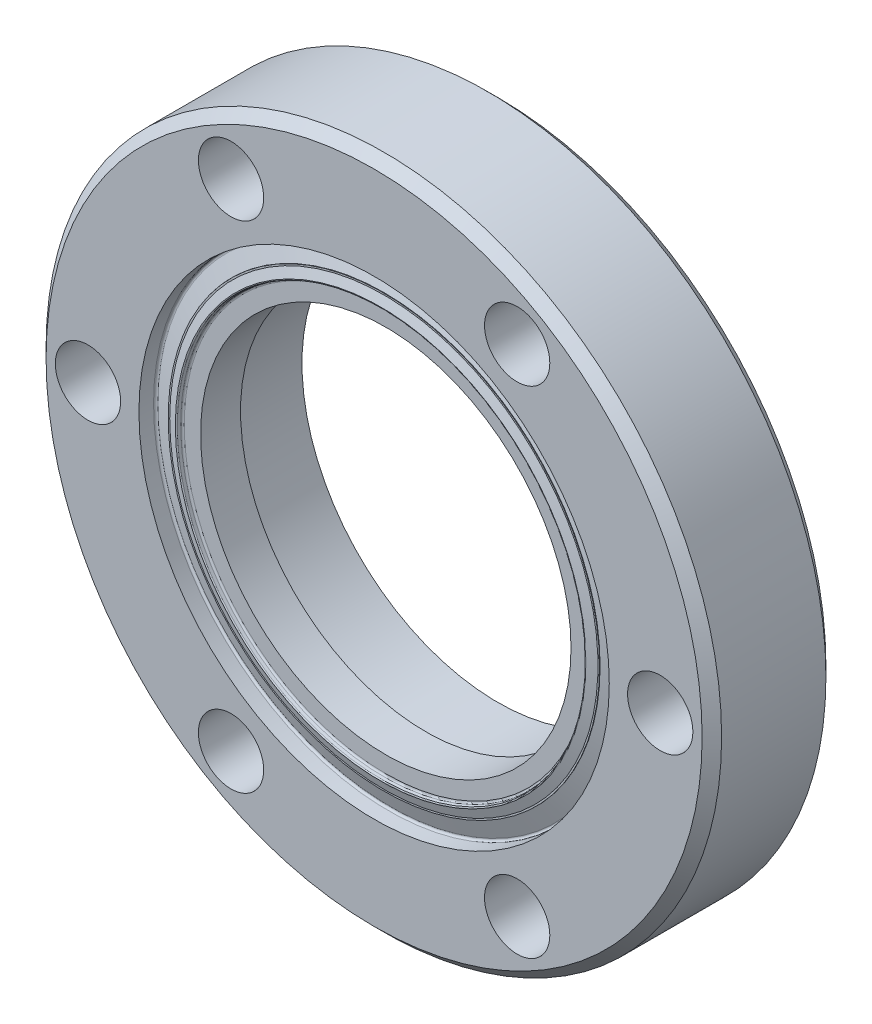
ISO-10303-21;
HEADER;
FILE_DESCRIPTION(('STEP AP214'),'2;1');
FILE_NAME('part.step','',(''),(''),'','','');
FILE_SCHEMA(('AUTOMOTIVE_DESIGN { 1 0 10303 214 1 1 1 1 }'));
ENDSEC;
DATA;
#1=APPLICATION_CONTEXT('core data for automotive mechanical design processes');
#2=APPLICATION_PROTOCOL_DEFINITION('international standard','automotive_design',2000,#1);
#3=PRODUCT_CONTEXT('',#1,'mechanical');
#4=PRODUCT('Part','Part','',(#3));
#5=PRODUCT_RELATED_PRODUCT_CATEGORY('part','',(#4));
#6=PRODUCT_DEFINITION_FORMATION('','',#4);
#7=PRODUCT_DEFINITION_CONTEXT('part definition',#1,'design');
#8=PRODUCT_DEFINITION('design','',#6,#7);
#9=PRODUCT_DEFINITION_SHAPE('','',#8);
#10=(LENGTH_UNIT() NAMED_UNIT(*) SI_UNIT(.MILLI.,.METRE.));
#11=(NAMED_UNIT(*) PLANE_ANGLE_UNIT() SI_UNIT($,.RADIAN.));
#12=(NAMED_UNIT(*) SI_UNIT($,.STERADIAN.) SOLID_ANGLE_UNIT());
#13=UNCERTAINTY_MEASURE_WITH_UNIT(LENGTH_MEASURE(1.E-05),#10,'distance_accuracy_value','');
#14=(GEOMETRIC_REPRESENTATION_CONTEXT(3) GLOBAL_UNCERTAINTY_ASSIGNED_CONTEXT((#13)) GLOBAL_UNIT_ASSIGNED_CONTEXT((#10,
#11,#12)) REPRESENTATION_CONTEXT('',''));
#15=CARTESIAN_POINT('',(0.,0.,0.));
#16=DIRECTION('',(0.,0.,1.));
#17=DIRECTION('',(1.,0.,0.));
#18=AXIS2_PLACEMENT_3D('',#15,#16,#17);
#19=CARTESIAN_POINT('',(0.,0.,11.7));
#20=DIRECTION('',(0.,0.,-1.));
#21=DIRECTION('',(-1.,0.,0.));
#22=AXIS2_PLACEMENT_3D('',#19,#20,#21);
#23=CONICAL_SURFACE('',#22,21.9665666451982,1.22173047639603);
#24=CARTESIAN_POINT('',(0.,0.,12.0292396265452));
#25=DIRECTION('',(0.,0.,1.));
#26=DIRECTION('',(1.,0.,0.));
#27=AXIS2_PLACEMENT_3D('',#24,#25,#26);
#28=CIRCLE('',#27,21.0619882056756);
#29=CARTESIAN_POINT('',(21.0619882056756,0.,12.0292396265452));
#30=VERTEX_POINT('',#29);
#31=EDGE_CURVE('E54',#30,#30,#28,.T.);
#32=ORIENTED_EDGE('',*,*,#31,.F.);
#33=EDGE_LOOP('',(#32));
#34=FACE_BOUND('',#33,.T.);
#35=CARTESIAN_POINT('',(0.,0.,11.7));
#36=DIRECTION('',(0.,0.,-1.));
#37=DIRECTION('',(-1.,0.,0.));
#38=AXIS2_PLACEMENT_3D('',#35,#36,#37);
#39=CIRCLE('',#38,21.9665666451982);
#40=CARTESIAN_POINT('',(-21.9665666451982,0.,11.7));
#41=VERTEX_POINT('',#40);
#42=EDGE_CURVE('E51',#41,#41,#39,.T.);
#43=ORIENTED_EDGE('',*,*,#42,.F.);
#44=EDGE_LOOP('',(#43));
#45=FACE_BOUND('',#44,.T.);
#46=ADVANCED_FACE('F19',(#34,#45),#23,.T.);
#47=CARTESIAN_POINT('',(0.,23.925,11.7));
#48=DIRECTION('',(0.,0.,1.));
#49=DIRECTION('',(1.,0.,0.));
#50=AXIS2_PLACEMENT_3D('',#47,#48,#49);
#51=PLANE('',#50);
#52=CARTESIAN_POINT('',(0.,0.,11.7));
#53=DIRECTION('',(0.,0.,1.));
#54=DIRECTION('',(1.,0.,0.));
#55=AXIS2_PLACEMENT_3D('',#52,#53,#54);
#56=CIRCLE('',#55,22.125);
#57=CARTESIAN_POINT('',(22.125,0.,11.7));
#58=VERTEX_POINT('',#57);
#59=EDGE_CURVE('E55',#58,#58,#56,.F.);
#60=ORIENTED_EDGE('',*,*,#59,.F.);
#61=EDGE_LOOP('',(#60));
#62=FACE_BOUND('',#61,.T.);
#63=ORIENTED_EDGE('',*,*,#42,.T.);
#64=EDGE_LOOP('',(#63));
#65=FACE_BOUND('',#64,.T.);
#66=ADVANCED_FACE('F124',(#62,#65),#51,.T.);
#67=CARTESIAN_POINT('',(0.,0.,11.9352703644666));
#68=DIRECTION('',(0.,0.,1.));
#69=DIRECTION('',(1.,0.,0.));
#70=AXIS2_PLACEMENT_3D('',#67,#68,#69);
#71=TOROIDAL_SURFACE('',#70,21.027786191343,0.0999999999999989);
#72=ORIENTED_EDGE('',*,*,#31,.T.);
#73=EDGE_LOOP('',(#72));
#74=FACE_BOUND('',#73,.T.);
#75=CARTESIAN_POINT('',(0.,0.,11.9526351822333));
#76=DIRECTION('',(0.,0.,1.));
#77=DIRECTION('',(1.,0.,0.));
#78=AXIS2_PLACEMENT_3D('',#75,#76,#77);
#79=CIRCLE('',#78,20.9293054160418);
#80=CARTESIAN_POINT('',(20.9293054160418,0.,11.9526351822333));
#81=VERTEX_POINT('',#80);
#82=EDGE_CURVE('E58',#81,#81,#79,.F.);
#83=ORIENTED_EDGE('',*,*,#82,.T.);
#84=EDGE_LOOP('',(#83));
#85=FACE_BOUND('',#84,.T.);
#86=ADVANCED_FACE('F120',(#74,#85),#71,.T.);
#87=CARTESIAN_POINT('',(0.,0.,31.6838263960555));
#88=DIRECTION('',(0.,0.,1.));
#89=DIRECTION('',(1.,0.,0.));
#90=AXIS2_PLACEMENT_3D('',#87,#88,#89);
#91=CYLINDRICAL_SURFACE('',#90,22.125);
#92=CARTESIAN_POINT('',(0.,0.,11.6423349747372));
#93=DIRECTION('',(0.,0.,-1.));
#94=DIRECTION('',(-1.,0.,0.));
#95=AXIS2_PLACEMENT_3D('',#92,#93,#94);
#96=CIRCLE('',#95,22.125);
#97=CARTESIAN_POINT('',(-22.125,0.,11.6423349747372));
#98=VERTEX_POINT('',#97);
#99=EDGE_CURVE('E256',#98,#98,#96,.T.);
#100=ORIENTED_EDGE('',*,*,#99,.F.);
#101=EDGE_LOOP('',(#100));
#102=FACE_BOUND('',#101,.T.);
#103=ORIENTED_EDGE('',*,*,#59,.T.);
#104=EDGE_LOOP('',(#103));
#105=FACE_BOUND('',#104,.T.);
#106=ADVANCED_FACE('F123',(#102,#105),#91,.T.);
#107=CARTESIAN_POINT('',(0.,0.,11.9526351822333));
#108=DIRECTION('',(0.,0.,1.));
#109=DIRECTION('',(1.,0.,0.));
#110=AXIS2_PLACEMENT_3D('',#107,#108,#109);
#111=CONICAL_SURFACE('',#110,20.9293054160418,0.174532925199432);
#112=ORIENTED_EDGE('',*,*,#82,.F.);
#113=EDGE_LOOP('',(#112));
#114=FACE_BOUND('',#113,.T.);
#115=CARTESIAN_POINT('',(0.,0.,11.6652703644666));
#116=DIRECTION('',(0.,0.,1.));
#117=DIRECTION('',(1.,0.,0.));
#118=AXIS2_PLACEMENT_3D('',#115,#116,#117);
#119=CIRCLE('',#118,20.8786352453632);
#120=CARTESIAN_POINT('',(20.8786352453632,0.,11.6652703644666));
#121=VERTEX_POINT('',#120);
#122=EDGE_CURVE('E254',#121,#121,#119,.F.);
#123=ORIENTED_EDGE('',*,*,#122,.T.);
#124=EDGE_LOOP('',(#123));
#125=FACE_BOUND('',#124,.T.);
#126=ADVANCED_FACE('F264',(#114,#125),#111,.F.);
#127=CARTESIAN_POINT('',(0.,0.,11.012085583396));
#128=DIRECTION('',(0.,0.,-1.));
#129=DIRECTION('',(-1.,0.,0.));
#130=AXIS2_PLACEMENT_3D('',#127,#128,#129);
#131=CONICAL_SURFACE('',#130,23.8565959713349,1.22173047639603);
#132=ORIENTED_EDGE('',*,*,#99,.T.);
#133=EDGE_LOOP('',(#132));
#134=FACE_BOUND('',#133,.T.);
#135=CARTESIAN_POINT('',(0.,0.,11.012085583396));
#136=DIRECTION('',(0.,0.,1.));
#137=DIRECTION('',(1.,0.,0.));
#138=AXIS2_PLACEMENT_3D('',#135,#136,#137);
#139=CIRCLE('',#138,23.8565959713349);
#140=CARTESIAN_POINT('',(23.8565959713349,0.,11.012085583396));
#141=VERTEX_POINT('',#140);
#142=EDGE_CURVE('E49',#141,#141,#139,.T.);
#143=ORIENTED_EDGE('',*,*,#142,.T.);
#144=EDGE_LOOP('',(#143));
#145=FACE_BOUND('',#144,.T.);
#146=ADVANCED_FACE('F241',(#134,#145),#131,.T.);
#147=CARTESIAN_POINT('',(0.,0.,11.7));
#148=DIRECTION('',(0.,0.,1.));
#149=DIRECTION('',(1.,0.,0.));
#150=AXIS2_PLACEMENT_3D('',#147,#148,#149);
#151=TOROIDAL_SURFACE('',#150,20.6816736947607,0.199999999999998);
#152=ORIENTED_EDGE('',*,*,#122,.F.);
#153=EDGE_LOOP('',(#152));
#154=FACE_BOUND('',#153,.T.);
#155=CARTESIAN_POINT('',(0.,0.,11.5));
#156=DIRECTION('',(0.,0.,-1.));
#157=DIRECTION('',(1.,0.,0.));
#158=AXIS2_PLACEMENT_3D('',#155,#156,#157);
#159=CIRCLE('',#158,20.6816736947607);
#160=CARTESIAN_POINT('',(-20.6816736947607,0.,11.5));
#161=VERTEX_POINT('',#160);
#162=CARTESIAN_POINT('',(20.6816736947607,0.,11.5));
#163=VERTEX_POINT('',#162);
#164=EDGE_CURVE('E39',#161,#163,#159,.F.);
#165=ORIENTED_EDGE('',*,*,#164,.F.);
#166=CARTESIAN_POINT('',(0.,0.,11.5));
#167=DIRECTION('',(0.,0.,-1.));
#168=DIRECTION('',(-1.,0.,0.));
#169=AXIS2_PLACEMENT_3D('',#166,#167,#168);
#170=CIRCLE('',#169,20.6816736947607);
#171=EDGE_CURVE('E36',#163,#161,#170,.F.);
#172=ORIENTED_EDGE('',*,*,#171,.F.);
#173=EDGE_LOOP('',(#165,#172));
#174=FACE_BOUND('',#173,.T.);
#175=ADVANCED_FACE('F48',(#154,#174),#151,.F.);
#176=CARTESIAN_POINT('',(0.,0.,11.2000241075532));
#177=DIRECTION('',(0.,0.,1.));
#178=DIRECTION('',(1.,0.,0.));
#179=AXIS2_PLACEMENT_3D('',#176,#177,#178);
#180=TOROIDAL_SURFACE('',#179,23.925,0.199999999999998);
#181=CARTESIAN_POINT('',(0.,0.,11.2000241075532));
#182=DIRECTION('',(0.,0.,1.));
#183=DIRECTION('',(1.,0.,0.));
#184=AXIS2_PLACEMENT_3D('',#181,#182,#183);
#185=CIRCLE('',#184,24.125);
#186=CARTESIAN_POINT('',(24.125,0.,11.2000241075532));
#187=VERTEX_POINT('',#186);
#188=EDGE_CURVE('E45',#187,#187,#185,.T.);
#189=ORIENTED_EDGE('',*,*,#188,.T.);
#190=EDGE_LOOP('',(#189));
#191=FACE_BOUND('',#190,.T.);
#192=ORIENTED_EDGE('',*,*,#142,.F.);
#193=EDGE_LOOP('',(#192));
#194=FACE_BOUND('',#193,.T.);
#195=ADVANCED_FACE('F204',(#191,#194),#180,.F.);
#196=CARTESIAN_POINT('',(0.,0.,11.5));
#197=DIRECTION('',(0.,0.,1.));
#198=DIRECTION('',(1.,0.,0.));
#199=AXIS2_PLACEMENT_3D('',#196,#197,#198);
#200=PLANE('',#199);
#201=ORIENTED_EDGE('',*,*,#171,.T.);
#202=ORIENTED_EDGE('',*,*,#164,.T.);
#203=EDGE_LOOP('',(#201,#202));
#204=FACE_BOUND('',#203,.T.);
#205=CARTESIAN_POINT('',(0.,0.,11.5));
#206=DIRECTION('',(0.,0.,1.));
#207=DIRECTION('',(1.,0.,0.));
#208=AXIS2_PLACEMENT_3D('',#205,#206,#207);
#209=CIRCLE('',#208,19.);
#210=CARTESIAN_POINT('',(19.,0.,11.5));
#211=VERTEX_POINT('',#210);
#212=EDGE_CURVE('E59',#211,#211,#209,.F.);
#213=ORIENTED_EDGE('',*,*,#212,.T.);
#214=EDGE_LOOP('',(#213));
#215=FACE_BOUND('',#214,.T.);
#216=ADVANCED_FACE('F41',(#204,#215),#200,.T.);
#217=CARTESIAN_POINT('',(0.,0.,11.7));
#218=DIRECTION('',(0.,0.,-1.));
#219=DIRECTION('',(-1.,0.,0.));
#220=AXIS2_PLACEMENT_3D('',#217,#218,#219);
#221=CONICAL_SURFACE('',#220,34.65,0.785398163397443);
#222=CARTESIAN_POINT('',(0.,0.,11.7));
#223=DIRECTION('',(0.,0.,-1.));
#224=DIRECTION('',(-1.,0.,0.));
#225=AXIS2_PLACEMENT_3D('',#222,#223,#224);
#226=CIRCLE('',#225,34.65);
#227=CARTESIAN_POINT('',(-34.65,0.,11.7));
#228=VERTEX_POINT('',#227);
#229=EDGE_CURVE('E62',#228,#228,#226,.T.);
#230=ORIENTED_EDGE('',*,*,#229,.F.);
#231=EDGE_LOOP('',(#230));
#232=FACE_BOUND('',#231,.T.);
#233=CARTESIAN_POINT('',(0.,0.,12.7));
#234=DIRECTION('',(0.,0.,-1.));
#235=DIRECTION('',(-1.,0.,0.));
#236=AXIS2_PLACEMENT_3D('',#233,#234,#235);
#237=CIRCLE('',#236,33.65);
#238=CARTESIAN_POINT('',(-33.65,0.,12.7));
#239=VERTEX_POINT('',#238);
#240=EDGE_CURVE('E63',#239,#239,#237,.F.);
#241=ORIENTED_EDGE('',*,*,#240,.F.);
#242=EDGE_LOOP('',(#241));
#243=FACE_BOUND('',#242,.T.);
#244=ADVANCED_FACE('F196',(#232,#243),#221,.T.);
#245=CARTESIAN_POINT('',(0.,0.,31.6838263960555));
#246=DIRECTION('',(0.,0.,1.));
#247=DIRECTION('',(1.,0.,0.));
#248=AXIS2_PLACEMENT_3D('',#245,#246,#247);
#249=CYLINDRICAL_SURFACE('',#248,24.125);
#250=CARTESIAN_POINT('',(0.,0.,12.7));
#251=DIRECTION('',(0.,0.,1.));
#252=DIRECTION('',(1.,0.,0.));
#253=AXIS2_PLACEMENT_3D('',#250,#251,#252);
#254=CIRCLE('',#253,24.125);
#255=CARTESIAN_POINT('',(24.125,0.,12.7));
#256=VERTEX_POINT('',#255);
#257=EDGE_CURVE('E66',#256,#256,#254,.F.);
#258=ORIENTED_EDGE('',*,*,#257,.F.);
#259=EDGE_LOOP('',(#258));
#260=FACE_BOUND('',#259,.T.);
#261=ORIENTED_EDGE('',*,*,#188,.F.);
#262=EDGE_LOOP('',(#261));
#263=FACE_BOUND('',#262,.T.);
#264=ADVANCED_FACE('F192',(#260,#263),#249,.F.);
#265=CARTESIAN_POINT('',(0.,0.,31.5));
#266=DIRECTION('',(0.,0.,1.));
#267=DIRECTION('',(1.,0.,0.));
#268=AXIS2_PLACEMENT_3D('',#265,#266,#267);
#269=CYLINDRICAL_SURFACE('',#268,19.);
#270=ORIENTED_EDGE('',*,*,#212,.F.);
#271=EDGE_LOOP('',(#270));
#272=FACE_BOUND('',#271,.T.);
#273=CARTESIAN_POINT('',(0.,0.,7.39999999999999));
#274=DIRECTION('',(0.,0.,1.));
#275=DIRECTION('',(1.,0.,0.));
#276=AXIS2_PLACEMENT_3D('',#273,#274,#275);
#277=CIRCLE('',#276,19.);
#278=CARTESIAN_POINT('',(19.,0.,7.39999999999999));
#279=VERTEX_POINT('',#278);
#280=EDGE_CURVE('E69',#279,#279,#277,.T.);
#281=ORIENTED_EDGE('',*,*,#280,.F.);
#282=EDGE_LOOP('',(#281));
#283=FACE_BOUND('',#282,.T.);
#284=ADVANCED_FACE('F188',(#272,#283),#269,.F.);
#285=CARTESIAN_POINT('',(0.,0.,12.7));
#286=DIRECTION('',(0.,0.,-1.));
#287=DIRECTION('',(-1.,0.,0.));
#288=AXIS2_PLACEMENT_3D('',#285,#286,#287);
#289=CYLINDRICAL_SURFACE('',#288,34.65);
#290=ORIENTED_EDGE('',*,*,#229,.T.);
#291=EDGE_LOOP('',(#290));
#292=FACE_BOUND('',#291,.T.);
#293=CARTESIAN_POINT('',(0.,0.,1.));
#294=DIRECTION('',(0.,0.,1.));
#295=DIRECTION('',(1.,0.,0.));
#296=AXIS2_PLACEMENT_3D('',#293,#294,#295);
#297=CIRCLE('',#296,34.65);
#298=CARTESIAN_POINT('',(34.65,0.,1.));
#299=VERTEX_POINT('',#298);
#300=EDGE_CURVE('E72',#299,#299,#297,.F.);
#301=ORIENTED_EDGE('',*,*,#300,.F.);
#302=EDGE_LOOP('',(#301));
#303=FACE_BOUND('',#302,.T.);
#304=ADVANCED_FACE('F184',(#292,#303),#289,.T.);
#305=CARTESIAN_POINT('',(0.,0.,12.7));
#306=DIRECTION('',(0.,0.,1.));
#307=DIRECTION('',(1.,0.,0.));
#308=AXIS2_PLACEMENT_3D('',#305,#306,#307);
#309=PLANE('',#308);
#310=ORIENTED_EDGE('',*,*,#257,.T.);
#311=EDGE_LOOP('',(#310));
#312=FACE_BOUND('',#311,.T.);
#313=CARTESIAN_POINT('',(29.35,5.28960657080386E-13,12.7));
#314=DIRECTION('',(0.,0.,1.));
#315=DIRECTION('',(1.,0.,0.));
#316=AXIS2_PLACEMENT_3D('',#313,#314,#315);
#317=CIRCLE('',#316,3.35);
#318=CARTESIAN_POINT('',(32.7,5.28960657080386E-13,12.7));
#319=VERTEX_POINT('',#318);
#320=EDGE_CURVE('E88',#319,#319,#317,.F.);
#321=ORIENTED_EDGE('',*,*,#320,.T.);
#322=EDGE_LOOP('',(#321));
#323=FACE_BOUND('',#322,.T.);
#324=CARTESIAN_POINT('',(14.6750000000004,-25.417845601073,12.7));
#325=DIRECTION('',(0.,0.,1.));
#326=DIRECTION('',(1.,0.,0.));
#327=AXIS2_PLACEMENT_3D('',#324,#325,#326);
#328=CIRCLE('',#327,3.35);
#329=CARTESIAN_POINT('',(18.0250000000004,-25.417845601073,12.7));
#330=VERTEX_POINT('',#329);
#331=EDGE_CURVE('E85',#330,#330,#328,.F.);
#332=ORIENTED_EDGE('',*,*,#331,.T.);
#333=EDGE_LOOP('',(#332));
#334=FACE_BOUND('',#333,.T.);
#335=CARTESIAN_POINT('',(-14.6749999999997,-25.4178456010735,12.7));
#336=DIRECTION('',(0.,0.,1.));
#337=DIRECTION('',(1.,0.,0.));
#338=AXIS2_PLACEMENT_3D('',#335,#336,#337);
#339=CIRCLE('',#338,3.35);
#340=CARTESIAN_POINT('',(-11.3249999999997,-25.4178456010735,12.7));
#341=VERTEX_POINT('',#340);
#342=EDGE_CURVE('E82',#341,#341,#339,.F.);
#343=ORIENTED_EDGE('',*,*,#342,.T.);
#344=EDGE_LOOP('',(#343));
#345=FACE_BOUND('',#344,.T.);
#346=CARTESIAN_POINT('',(-29.35,-3.20793839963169E-13,12.7));
#347=DIRECTION('',(0.,0.,1.));
#348=DIRECTION('',(1.,0.,0.));
#349=AXIS2_PLACEMENT_3D('',#346,#347,#348);
#350=CIRCLE('',#349,3.35);
#351=CARTESIAN_POINT('',(-26.,-3.20793839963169E-13,12.7));
#352=VERTEX_POINT('',#351);
#353=EDGE_CURVE('E79',#352,#352,#350,.F.);
#354=ORIENTED_EDGE('',*,*,#353,.T.);
#355=EDGE_LOOP('',(#354));
#356=FACE_BOUND('',#355,.T.);
#357=CARTESIAN_POINT('',(-14.6750000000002,25.4178456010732,12.7));
#358=DIRECTION('',(0.,0.,1.));
#359=DIRECTION('',(1.,0.,0.));
#360=AXIS2_PLACEMENT_3D('',#357,#358,#359);
#361=CIRCLE('',#360,3.35);
#362=CARTESIAN_POINT('',(-11.3250000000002,25.4178456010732,12.7));
#363=VERTEX_POINT('',#362);
#364=EDGE_CURVE('E76',#363,#363,#361,.F.);
#365=ORIENTED_EDGE('',*,*,#364,.T.);
#366=EDGE_LOOP('',(#365));
#367=FACE_BOUND('',#366,.T.);
#368=CARTESIAN_POINT('',(14.6749999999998,25.4178456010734,12.7));
#369=DIRECTION('',(0.,0.,1.));
#370=DIRECTION('',(1.,0.,0.));
#371=AXIS2_PLACEMENT_3D('',#368,#369,#370);
#372=CIRCLE('',#371,3.35);
#373=CARTESIAN_POINT('',(18.0249999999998,25.4178456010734,12.7));
#374=VERTEX_POINT('',#373);
#375=EDGE_CURVE('E73',#374,#374,#372,.F.);
#376=ORIENTED_EDGE('',*,*,#375,.T.);
#377=EDGE_LOOP('',(#376));
#378=FACE_BOUND('',#377,.T.);
#379=ORIENTED_EDGE('',*,*,#240,.T.);
#380=EDGE_LOOP('',(#379));
#381=FACE_BOUND('',#380,.T.);
#382=ADVANCED_FACE('F180',(#312,#323,#334,#345,#356,#367,#378,#381),#309,.T.);
#383=CARTESIAN_POINT('',(0.,19.,7.39999999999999));
#384=DIRECTION('',(0.,0.,-1.));
#385=DIRECTION('',(-1.,0.,0.));
#386=AXIS2_PLACEMENT_3D('',#383,#384,#385);
#387=PLANE('',#386);
#388=CARTESIAN_POINT('',(0.,0.,7.39999999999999));
#389=DIRECTION('',(0.,0.,1.));
#390=DIRECTION('',(1.,0.,0.));
#391=AXIS2_PLACEMENT_3D('',#388,#389,#390);
#392=CIRCLE('',#391,20.1);
#393=CARTESIAN_POINT('',(20.1,0.,7.39999999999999));
#394=VERTEX_POINT('',#393);
#395=EDGE_CURVE('E91',#394,#394,#392,.F.);
#396=ORIENTED_EDGE('',*,*,#395,.T.);
#397=EDGE_LOOP('',(#396));
#398=FACE_BOUND('',#397,.T.);
#399=ORIENTED_EDGE('',*,*,#280,.T.);
#400=EDGE_LOOP('',(#399));
#401=FACE_BOUND('',#400,.T.);
#402=ADVANCED_FACE('F176',(#398,#401),#387,.T.);
#403=CARTESIAN_POINT('',(0.,0.,1.));
#404=DIRECTION('',(0.,0.,1.));
#405=DIRECTION('',(1.,0.,0.));
#406=AXIS2_PLACEMENT_3D('',#403,#404,#405);
#407=CONICAL_SURFACE('',#406,34.65,0.785398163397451);
#408=CARTESIAN_POINT('',(0.,0.,0.));
#409=DIRECTION('',(0.,0.,1.));
#410=DIRECTION('',(1.,0.,0.));
#411=AXIS2_PLACEMENT_3D('',#408,#409,#410);
#412=CIRCLE('',#411,33.65);
#413=CARTESIAN_POINT('',(33.65,0.,0.));
#414=VERTEX_POINT('',#413);
#415=EDGE_CURVE('E94',#414,#414,#412,.T.);
#416=ORIENTED_EDGE('',*,*,#415,.T.);
#417=EDGE_LOOP('',(#416));
#418=FACE_BOUND('',#417,.T.);
#419=ORIENTED_EDGE('',*,*,#300,.T.);
#420=EDGE_LOOP('',(#419));
#421=FACE_BOUND('',#420,.T.);
#422=ADVANCED_FACE('F172',(#418,#421),#407,.T.);
#423=CARTESIAN_POINT('',(14.6749999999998,25.4178456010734,0.));
#424=DIRECTION('',(0.,0.,1.));
#425=DIRECTION('',(1.,0.,0.));
#426=AXIS2_PLACEMENT_3D('',#423,#424,#425);
#427=CYLINDRICAL_SURFACE('',#426,3.35);
#428=CARTESIAN_POINT('',(14.6749999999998,25.4178456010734,0.));
#429=DIRECTION('',(0.,0.,1.));
#430=DIRECTION('',(1.,0.,0.));
#431=AXIS2_PLACEMENT_3D('',#428,#429,#430);
#432=CIRCLE('',#431,3.35);
#433=CARTESIAN_POINT('',(18.0249999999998,25.4178456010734,0.));
#434=VERTEX_POINT('',#433);
#435=EDGE_CURVE('E97',#434,#434,#432,.F.);
#436=ORIENTED_EDGE('',*,*,#435,.T.);
#437=EDGE_LOOP('',(#436));
#438=FACE_BOUND('',#437,.T.);
#439=ORIENTED_EDGE('',*,*,#375,.F.);
#440=EDGE_LOOP('',(#439));
#441=FACE_BOUND('',#440,.T.);
#442=ADVANCED_FACE('F168',(#438,#441),#427,.F.);
#443=CARTESIAN_POINT('',(-14.6750000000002,25.4178456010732,0.));
#444=DIRECTION('',(0.,0.,1.));
#445=DIRECTION('',(1.,0.,0.));
#446=AXIS2_PLACEMENT_3D('',#443,#444,#445);
#447=CYLINDRICAL_SURFACE('',#446,3.35);
#448=CARTESIAN_POINT('',(-14.6750000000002,25.4178456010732,0.));
#449=DIRECTION('',(0.,0.,1.));
#450=DIRECTION('',(1.,0.,0.));
#451=AXIS2_PLACEMENT_3D('',#448,#449,#450);
#452=CIRCLE('',#451,3.35);
#453=CARTESIAN_POINT('',(-11.3250000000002,25.4178456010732,0.));
#454=VERTEX_POINT('',#453);
#455=EDGE_CURVE('E100',#454,#454,#452,.F.);
#456=ORIENTED_EDGE('',*,*,#455,.T.);
#457=EDGE_LOOP('',(#456));
#458=FACE_BOUND('',#457,.T.);
#459=ORIENTED_EDGE('',*,*,#364,.F.);
#460=EDGE_LOOP('',(#459));
#461=FACE_BOUND('',#460,.T.);
#462=ADVANCED_FACE('F164',(#458,#461),#447,.F.);
#463=CARTESIAN_POINT('',(-29.35,-3.20793839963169E-13,0.));
#464=DIRECTION('',(0.,0.,1.));
#465=DIRECTION('',(1.,0.,0.));
#466=AXIS2_PLACEMENT_3D('',#463,#464,#465);
#467=CYLINDRICAL_SURFACE('',#466,3.35);
#468=CARTESIAN_POINT('',(-29.35,-3.20793839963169E-13,0.));
#469=DIRECTION('',(0.,0.,1.));
#470=DIRECTION('',(1.,0.,0.));
#471=AXIS2_PLACEMENT_3D('',#468,#469,#470);
#472=CIRCLE('',#471,3.35);
#473=CARTESIAN_POINT('',(-26.,-3.20793839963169E-13,0.));
#474=VERTEX_POINT('',#473);
#475=EDGE_CURVE('E103',#474,#474,#472,.F.);
#476=ORIENTED_EDGE('',*,*,#475,.T.);
#477=EDGE_LOOP('',(#476));
#478=FACE_BOUND('',#477,.T.);
#479=ORIENTED_EDGE('',*,*,#353,.F.);
#480=EDGE_LOOP('',(#479));
#481=FACE_BOUND('',#480,.T.);
#482=ADVANCED_FACE('F160',(#478,#481),#467,.F.);
#483=CARTESIAN_POINT('',(-14.6749999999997,-25.4178456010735,0.));
#484=DIRECTION('',(0.,0.,1.));
#485=DIRECTION('',(1.,0.,0.));
#486=AXIS2_PLACEMENT_3D('',#483,#484,#485);
#487=CYLINDRICAL_SURFACE('',#486,3.35);
#488=CARTESIAN_POINT('',(-14.6749999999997,-25.4178456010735,0.));
#489=DIRECTION('',(0.,0.,1.));
#490=DIRECTION('',(1.,0.,0.));
#491=AXIS2_PLACEMENT_3D('',#488,#489,#490);
#492=CIRCLE('',#491,3.35);
#493=CARTESIAN_POINT('',(-11.3249999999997,-25.4178456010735,0.));
#494=VERTEX_POINT('',#493);
#495=EDGE_CURVE('E106',#494,#494,#492,.F.);
#496=ORIENTED_EDGE('',*,*,#495,.T.);
#497=EDGE_LOOP('',(#496));
#498=FACE_BOUND('',#497,.T.);
#499=ORIENTED_EDGE('',*,*,#342,.F.);
#500=EDGE_LOOP('',(#499));
#501=FACE_BOUND('',#500,.T.);
#502=ADVANCED_FACE('F156',(#498,#501),#487,.F.);
#503=CARTESIAN_POINT('',(14.6750000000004,-25.417845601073,0.));
#504=DIRECTION('',(0.,0.,1.));
#505=DIRECTION('',(1.,0.,0.));
#506=AXIS2_PLACEMENT_3D('',#503,#504,#505);
#507=CYLINDRICAL_SURFACE('',#506,3.35);
#508=CARTESIAN_POINT('',(14.6750000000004,-25.417845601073,0.));
#509=DIRECTION('',(0.,0.,1.));
#510=DIRECTION('',(1.,0.,0.));
#511=AXIS2_PLACEMENT_3D('',#508,#509,#510);
#512=CIRCLE('',#511,3.35);
#513=CARTESIAN_POINT('',(18.0250000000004,-25.417845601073,0.));
#514=VERTEX_POINT('',#513);
#515=EDGE_CURVE('E109',#514,#514,#512,.F.);
#516=ORIENTED_EDGE('',*,*,#515,.T.);
#517=EDGE_LOOP('',(#516));
#518=FACE_BOUND('',#517,.T.);
#519=ORIENTED_EDGE('',*,*,#331,.F.);
#520=EDGE_LOOP('',(#519));
#521=FACE_BOUND('',#520,.T.);
#522=ADVANCED_FACE('F152',(#518,#521),#507,.F.);
#523=CARTESIAN_POINT('',(29.35,5.28960657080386E-13,0.));
#524=DIRECTION('',(0.,0.,1.));
#525=DIRECTION('',(1.,0.,0.));
#526=AXIS2_PLACEMENT_3D('',#523,#524,#525);
#527=CYLINDRICAL_SURFACE('',#526,3.35);
#528=CARTESIAN_POINT('',(29.35,5.28960657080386E-13,0.));
#529=DIRECTION('',(0.,0.,1.));
#530=DIRECTION('',(1.,0.,0.));
#531=AXIS2_PLACEMENT_3D('',#528,#529,#530);
#532=CIRCLE('',#531,3.35);
#533=CARTESIAN_POINT('',(32.7,5.28960657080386E-13,0.));
#534=VERTEX_POINT('',#533);
#535=EDGE_CURVE('E30',#534,#534,#532,.F.);
#536=ORIENTED_EDGE('',*,*,#535,.T.);
#537=EDGE_LOOP('',(#536));
#538=FACE_BOUND('',#537,.T.);
#539=ORIENTED_EDGE('',*,*,#320,.F.);
#540=EDGE_LOOP('',(#539));
#541=FACE_BOUND('',#540,.T.);
#542=ADVANCED_FACE('F144',(#538,#541),#527,.F.);
#543=CARTESIAN_POINT('',(0.,0.,31.5));
#544=DIRECTION('',(0.,0.,1.));
#545=DIRECTION('',(1.,0.,0.));
#546=AXIS2_PLACEMENT_3D('',#543,#544,#545);
#547=CYLINDRICAL_SURFACE('',#546,20.1);
#548=CARTESIAN_POINT('',(0.,0.,0.));
#549=DIRECTION('',(0.,0.,1.));
#550=DIRECTION('',(1.,0.,0.));
#551=AXIS2_PLACEMENT_3D('',#548,#549,#550);
#552=CIRCLE('',#551,20.1);
#553=CARTESIAN_POINT('',(20.1,0.,0.));
#554=VERTEX_POINT('',#553);
#555=EDGE_CURVE('E11',#554,#554,#552,.F.);
#556=ORIENTED_EDGE('',*,*,#555,.T.);
#557=EDGE_LOOP('',(#556));
#558=FACE_BOUND('',#557,.T.);
#559=ORIENTED_EDGE('',*,*,#395,.F.);
#560=EDGE_LOOP('',(#559));
#561=FACE_BOUND('',#560,.T.);
#562=ADVANCED_FACE('F138',(#558,#561),#547,.F.);
#563=CARTESIAN_POINT('',(0.,0.,0.));
#564=DIRECTION('',(0.,0.,1.));
#565=DIRECTION('',(1.,0.,0.));
#566=AXIS2_PLACEMENT_3D('',#563,#564,#565);
#567=PLANE('',#566);
#568=ORIENTED_EDGE('',*,*,#555,.F.);
#569=EDGE_LOOP('',(#568));
#570=FACE_BOUND('',#569,.T.);
#571=ORIENTED_EDGE('',*,*,#535,.F.);
#572=EDGE_LOOP('',(#571));
#573=FACE_BOUND('',#572,.T.);
#574=ORIENTED_EDGE('',*,*,#515,.F.);
#575=EDGE_LOOP('',(#574));
#576=FACE_BOUND('',#575,.T.);
#577=ORIENTED_EDGE('',*,*,#495,.F.);
#578=EDGE_LOOP('',(#577));
#579=FACE_BOUND('',#578,.T.);
#580=ORIENTED_EDGE('',*,*,#475,.F.);
#581=EDGE_LOOP('',(#580));
#582=FACE_BOUND('',#581,.T.);
#583=ORIENTED_EDGE('',*,*,#455,.F.);
#584=EDGE_LOOP('',(#583));
#585=FACE_BOUND('',#584,.T.);
#586=ORIENTED_EDGE('',*,*,#435,.F.);
#587=EDGE_LOOP('',(#586));
#588=FACE_BOUND('',#587,.T.);
#589=ORIENTED_EDGE('',*,*,#415,.F.);
#590=EDGE_LOOP('',(#589));
#591=FACE_BOUND('',#590,.T.);
#592=ADVANCED_FACE('F136',(#570,#573,#576,#579,#582,#585,#588,#591),#567,.F.);
#593=CLOSED_SHELL('',(#46,#66,#86,#106,#126,#146,#175,#195,#216,#244,#264,#284,#304,#382,#402,
#422,#442,#462,#482,#502,#522,#542,#562,#592));
#594=MANIFOLD_SOLID_BREP('B1',#593);
#595=ADVANCED_BREP_SHAPE_REPRESENTATION('',(#18,#594),#14);
#596=SHAPE_DEFINITION_REPRESENTATION(#9,#595);
ENDSEC;
END-ISO-10303-21;
